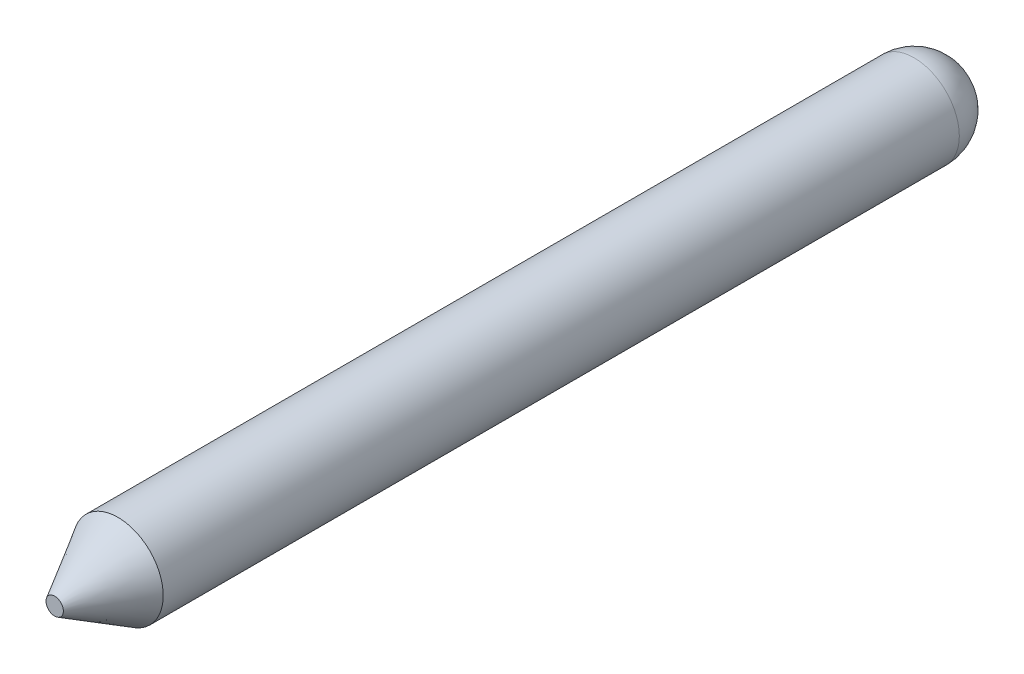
ISO-10303-21;
HEADER;
FILE_DESCRIPTION(('STEP AP214'),'2;1');
FILE_NAME('part.step','',(''),(''),'','','');
FILE_SCHEMA(('AUTOMOTIVE_DESIGN { 1 0 10303 214 1 1 1 1 }'));
ENDSEC;
DATA;
#1=APPLICATION_CONTEXT('core data for automotive mechanical design processes');
#2=APPLICATION_PROTOCOL_DEFINITION('international standard','automotive_design',2000,#1);
#3=PRODUCT_CONTEXT('',#1,'mechanical');
#4=PRODUCT('Part','Part','',(#3));
#5=PRODUCT_RELATED_PRODUCT_CATEGORY('part','',(#4));
#6=PRODUCT_DEFINITION_FORMATION('','',#4);
#7=PRODUCT_DEFINITION_CONTEXT('part definition',#1,'design');
#8=PRODUCT_DEFINITION('design','',#6,#7);
#9=PRODUCT_DEFINITION_SHAPE('','',#8);
#10=(LENGTH_UNIT() NAMED_UNIT(*) SI_UNIT(.MILLI.,.METRE.));
#11=(NAMED_UNIT(*) PLANE_ANGLE_UNIT() SI_UNIT($,.RADIAN.));
#12=(NAMED_UNIT(*) SI_UNIT($,.STERADIAN.) SOLID_ANGLE_UNIT());
#13=UNCERTAINTY_MEASURE_WITH_UNIT(LENGTH_MEASURE(1.E-05),#10,'distance_accuracy_value','');
#14=(GEOMETRIC_REPRESENTATION_CONTEXT(3) GLOBAL_UNCERTAINTY_ASSIGNED_CONTEXT((#13)) GLOBAL_UNIT_ASSIGNED_CONTEXT((#10,
#11,#12)) REPRESENTATION_CONTEXT('',''));
#15=CARTESIAN_POINT('',(0.,0.,0.));
#16=DIRECTION('',(0.,0.,1.));
#17=DIRECTION('',(1.,0.,0.));
#18=AXIS2_PLACEMENT_3D('',#15,#16,#17);
#19=CARTESIAN_POINT('',(0.,0.,100.));
#20=DIRECTION('',(0.,0.,-1.));
#21=DIRECTION('',(-1.,0.,0.));
#22=AXIS2_PLACEMENT_3D('',#19,#20,#21);
#23=CYLINDRICAL_SURFACE('',#22,5.);
#24=CARTESIAN_POINT('',(0.,0.,93.));
#25=DIRECTION('',(0.,0.,1.));
#26=DIRECTION('',(1.,0.,0.));
#27=AXIS2_PLACEMENT_3D('',#24,#25,#26);
#28=CIRCLE('',#27,5.);
#29=CARTESIAN_POINT('',(-5.00000000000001,0.,93.));
#30=VERTEX_POINT('',#29);
#31=EDGE_CURVE('E10',#30,#30,#28,.F.);
#32=ORIENTED_EDGE('',*,*,#31,.T.);
#33=EDGE_LOOP('',(#32));
#34=FACE_BOUND('',#33,.T.);
#35=CARTESIAN_POINT('',(0.,0.,5.));
#36=DIRECTION('',(0.,0.,-1.));
#37=DIRECTION('',(-1.,0.,0.));
#38=AXIS2_PLACEMENT_3D('',#35,#36,#37);
#39=CIRCLE('',#38,5.);
#40=CARTESIAN_POINT('',(-5.,0.,5.));
#41=VERTEX_POINT('',#40);
#42=EDGE_CURVE('E41',#41,#41,#39,.F.);
#43=ORIENTED_EDGE('',*,*,#42,.T.);
#44=EDGE_LOOP('',(#43));
#45=FACE_BOUND('',#44,.T.);
#46=ADVANCED_FACE('F30',(#34,#45),#23,.T.);
#47=CARTESIAN_POINT('',(0.,0.,100.));
#48=DIRECTION('',(0.,0.,1.));
#49=DIRECTION('',(1.,0.,0.));
#50=AXIS2_PLACEMENT_3D('',#47,#48,#49);
#51=PLANE('',#50);
#52=CARTESIAN_POINT('',(0.,0.,100.));
#53=DIRECTION('',(0.,0.,1.));
#54=DIRECTION('',(1.,0.,0.));
#55=AXIS2_PLACEMENT_3D('',#52,#53,#54);
#56=CIRCLE('',#55,0.958548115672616);
#57=CARTESIAN_POINT('',(-0.958548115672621,0.,100.));
#58=VERTEX_POINT('',#57);
#59=EDGE_CURVE('E37',#58,#58,#56,.T.);
#60=ORIENTED_EDGE('',*,*,#59,.T.);
#61=EDGE_LOOP('',(#60));
#62=FACE_BOUND('',#61,.T.);
#63=ADVANCED_FACE('F51',(#62),#51,.T.);
#64=CARTESIAN_POINT('',(0.,0.,5.));
#65=DIRECTION('',(0.,0.,1.));
#66=DIRECTION('',(1.,0.,0.));
#67=AXIS2_PLACEMENT_3D('',#64,#65,#66);
#68=SPHERICAL_SURFACE('',#67,5.);
#69=ORIENTED_EDGE('',*,*,#42,.F.);
#70=EDGE_LOOP('',(#69));
#71=FACE_BOUND('',#70,.T.);
#72=ADVANCED_FACE('F49',(#71),#68,.T.);
#73=CARTESIAN_POINT('',(0.,0.,100.));
#74=DIRECTION('',(0.,0.,-1.));
#75=DIRECTION('',(-1.,0.,0.));
#76=AXIS2_PLACEMENT_3D('',#73,#74,#75);
#77=CONICAL_SURFACE('',#76,0.958548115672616,0.523598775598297);
#78=CARTESIAN_POINT('',(-5.00000000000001,0.,93.));
#79=CARTESIAN_POINT('',(-4.9579015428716,0.,93.0729166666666));
#80=CARTESIAN_POINT('',(-4.91580308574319,0.,93.1458333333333));
#81=CARTESIAN_POINT('',(-4.83160617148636,0.,93.2916666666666));
#82=CARTESIAN_POINT('',(-4.78950771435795,0.,93.3645833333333));
#83=CARTESIAN_POINT('',(-4.70531080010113,0.,93.5104166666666));
#84=CARTESIAN_POINT('',(-4.66321234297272,0.,93.5833333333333));
#85=CARTESIAN_POINT('',(-4.5790154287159,0.,93.7291666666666));
#86=CARTESIAN_POINT('',(-4.53691697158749,0.,93.8020833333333));
#87=CARTESIAN_POINT('',(-4.45272005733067,0.,93.9479166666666));
#88=CARTESIAN_POINT('',(-4.41062160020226,0.,94.0208333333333));
#89=CARTESIAN_POINT('',(-4.32642468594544,0.,94.1666666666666));
#90=CARTESIAN_POINT('',(-4.28432622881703,0.,94.2395833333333));
#91=CARTESIAN_POINT('',(-4.20012931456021,0.,94.3854166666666));
#92=CARTESIAN_POINT('',(-4.1580308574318,0.,94.4583333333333));
#93=CARTESIAN_POINT('',(-4.07383394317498,0.,94.6041666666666));
#94=CARTESIAN_POINT('',(-4.03173548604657,0.,94.6770833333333));
#95=CARTESIAN_POINT('',(-3.94753857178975,0.,94.8229166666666));
#96=CARTESIAN_POINT('',(-3.90544011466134,0.,94.8958333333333));
#97=CARTESIAN_POINT('',(-3.82124320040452,0.,95.0416666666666));
#98=CARTESIAN_POINT('',(-3.77914474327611,0.,95.1145833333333));
#99=CARTESIAN_POINT('',(-3.69494782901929,0.,95.2604166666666));
#100=CARTESIAN_POINT('',(-3.65284937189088,0.,95.3333333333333));
#101=CARTESIAN_POINT('',(-3.56865245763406,0.,95.4791666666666));
#102=CARTESIAN_POINT('',(-3.52655400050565,0.,95.5520833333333));
#103=CARTESIAN_POINT('',(-3.44235708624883,0.,95.6979166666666));
#104=CARTESIAN_POINT('',(-3.40025862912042,0.,95.7708333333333));
#105=CARTESIAN_POINT('',(-3.31606171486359,0.,95.9166666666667));
#106=CARTESIAN_POINT('',(-3.27396325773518,0.,95.9895833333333));
#107=CARTESIAN_POINT('',(-3.18976634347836,0.,96.1354166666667));
#108=CARTESIAN_POINT('',(-3.14766788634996,0.,96.2083333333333));
#109=CARTESIAN_POINT('',(-3.06347097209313,0.,96.3541666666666));
#110=CARTESIAN_POINT('',(-3.02137251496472,0.,96.4270833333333));
#111=CARTESIAN_POINT('',(-2.9371756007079,0.,96.5729166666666));
#112=CARTESIAN_POINT('',(-2.89507714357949,0.,96.6458333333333));
#113=CARTESIAN_POINT('',(-2.81088022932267,0.,96.7916666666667));
#114=CARTESIAN_POINT('',(-2.76878177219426,0.,96.8645833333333));
#115=CARTESIAN_POINT('',(-2.68458485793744,0.,97.0104166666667));
#116=CARTESIAN_POINT('',(-2.64248640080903,0.,97.0833333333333));
#117=CARTESIAN_POINT('',(-2.55828948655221,0.,97.2291666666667));
#118=CARTESIAN_POINT('',(-2.5161910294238,0.,97.3020833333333));
#119=CARTESIAN_POINT('',(-2.43199411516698,0.,97.4479166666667));
#120=CARTESIAN_POINT('',(-2.38989565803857,0.,97.5208333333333));
#121=CARTESIAN_POINT('',(-2.30569874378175,0.,97.6666666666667));
#122=CARTESIAN_POINT('',(-2.26360028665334,0.,97.7395833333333));
#123=CARTESIAN_POINT('',(-2.17940337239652,0.,97.8854166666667));
#124=CARTESIAN_POINT('',(-2.13730491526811,0.,97.9583333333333));
#125=CARTESIAN_POINT('',(-2.05310800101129,0.,98.1041666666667));
#126=CARTESIAN_POINT('',(-2.01100954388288,0.,98.1770833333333));
#127=CARTESIAN_POINT('',(-1.92681262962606,0.,98.3229166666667));
#128=CARTESIAN_POINT('',(-1.88471417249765,0.,98.3958333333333));
#129=CARTESIAN_POINT('',(-1.80051725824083,0.,98.5416666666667));
#130=CARTESIAN_POINT('',(-1.75841880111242,0.,98.6145833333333));
#131=CARTESIAN_POINT('',(-1.6742218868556,0.,98.7604166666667));
#132=CARTESIAN_POINT('',(-1.63212342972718,0.,98.8333333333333));
#133=CARTESIAN_POINT('',(-1.54792651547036,0.,98.9791666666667));
#134=CARTESIAN_POINT('',(-1.50582805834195,0.,99.0520833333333));
#135=CARTESIAN_POINT('',(-1.42163114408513,0.,99.1979166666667));
#136=CARTESIAN_POINT('',(-1.37953268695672,0.,99.2708333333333));
#137=CARTESIAN_POINT('',(-1.2953357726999,0.,99.4166666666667));
#138=CARTESIAN_POINT('',(-1.25323731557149,0.,99.4895833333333));
#139=CARTESIAN_POINT('',(-1.16904040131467,0.,99.6354166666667));
#140=CARTESIAN_POINT('',(-1.12694194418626,0.,99.7083333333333));
#141=CARTESIAN_POINT('',(-1.04274502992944,0.,99.8541666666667));
#142=CARTESIAN_POINT('',(-1.00064657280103,0.,99.9270833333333));
#143=CARTESIAN_POINT('',(-0.958548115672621,0.,100.));
#144=B_SPLINE_CURVE_WITH_KNOTS('',3,(#78,#79,#80,#81,#82,#83,#84,#85,#86,#87,#88,#89,#90,#91,
#92,#93,#94,#95,#96,#97,#98,#99,#100,#101,#102,#103,#104,#105,#106,#107,#108,#109,#110,#111,
#112,#113,#114,#115,#116,#117,#118,#119,#120,#121,#122,#123,#124,#125,#126,#127,#128,#129,#130,
#131,#132,#133,#134,#135,#136,#137,#138,#139,#140,#141,#142,#143),.UNSPECIFIED.,.F.,.F.,(4,2,2,
2,2,2,2,2,2,2,2,2,2,2,2,2,2,2,2,2,2,2,2,2,2,2,2,2,2,2,2,2,4),(0.,0.252590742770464,
0.505181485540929,0.757772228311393,1.01036297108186,1.26295371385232,1.51554445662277,
1.76813519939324,2.0207259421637,2.27331668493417,2.52590742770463,2.77849817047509,
3.03108891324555,3.28367965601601,3.53627039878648,3.78886114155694,4.0414518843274,
4.29404262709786,4.54663336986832,4.79922411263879,5.05181485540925,5.30440559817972,
5.55699634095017,5.80958708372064,6.0621778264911,6.31476856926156,6.56735931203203,
6.81995005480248,7.07254079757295,7.32513154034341,7.57772228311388,7.83031302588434,
8.0829037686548),.UNSPECIFIED.);
#145=EDGE_CURVE('BSEAM32',#30,#58,#144,.T.);
#146=ORIENTED_EDGE('',*,*,#31,.F.);
#147=ORIENTED_EDGE('',*,*,#59,.F.);
#148=ORIENTED_EDGE('',*,*,#145,.T.);
#149=ORIENTED_EDGE('',*,*,#145,.F.);
#150=EDGE_LOOP('',(#146,#148,#147,#149));
#151=FACE_BOUND('',#150,.T.);
#152=ADVANCED_FACE('F32',(#151),#77,.T.);
#153=CLOSED_SHELL('',(#46,#63,#72,#152));
#154=MANIFOLD_SOLID_BREP('B2',#153);
#155=ADVANCED_BREP_SHAPE_REPRESENTATION('',(#18,#154),#14);
#156=SHAPE_DEFINITION_REPRESENTATION(#9,#155);
ENDSEC;
END-ISO-10303-21;
